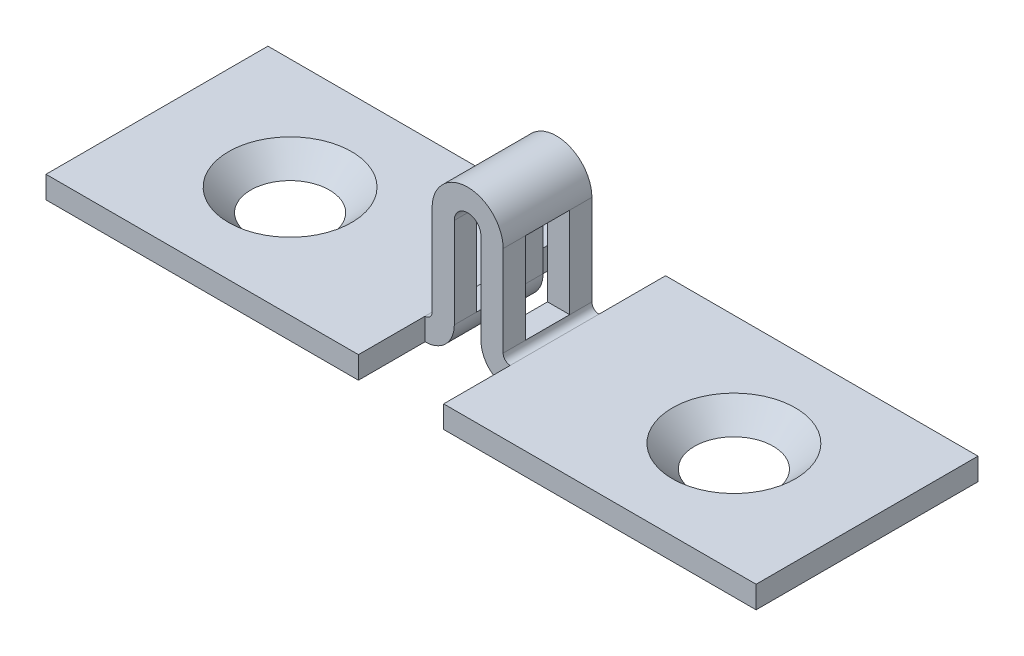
ISO-10303-21;
HEADER;
FILE_DESCRIPTION(('STEP AP214'),'2;1');
FILE_NAME('part.step','',(''),(''),'','','');
FILE_SCHEMA(('AUTOMOTIVE_DESIGN { 1 0 10303 214 1 1 1 1 }'));
ENDSEC;
DATA;
#1=APPLICATION_CONTEXT('core data for automotive mechanical design processes');
#2=APPLICATION_PROTOCOL_DEFINITION('international standard','automotive_design',2000,#1);
#3=PRODUCT_CONTEXT('',#1,'mechanical');
#4=PRODUCT('Part','Part','',(#3));
#5=PRODUCT_RELATED_PRODUCT_CATEGORY('part','',(#4));
#6=PRODUCT_DEFINITION_FORMATION('','',#4);
#7=PRODUCT_DEFINITION_CONTEXT('part definition',#1,'design');
#8=PRODUCT_DEFINITION('design','',#6,#7);
#9=PRODUCT_DEFINITION_SHAPE('','',#8);
#10=(LENGTH_UNIT() NAMED_UNIT(*) SI_UNIT(.MILLI.,.METRE.));
#11=(NAMED_UNIT(*) PLANE_ANGLE_UNIT() SI_UNIT($,.RADIAN.));
#12=(NAMED_UNIT(*) SI_UNIT($,.STERADIAN.) SOLID_ANGLE_UNIT());
#13=UNCERTAINTY_MEASURE_WITH_UNIT(LENGTH_MEASURE(1.E-05),#10,'distance_accuracy_value','');
#14=(GEOMETRIC_REPRESENTATION_CONTEXT(3) GLOBAL_UNCERTAINTY_ASSIGNED_CONTEXT((#13)) GLOBAL_UNIT_ASSIGNED_CONTEXT((#10,
#11,#12)) REPRESENTATION_CONTEXT('',''));
#15=CARTESIAN_POINT('',(0.,0.,0.));
#16=DIRECTION('',(0.,0.,1.));
#17=DIRECTION('',(1.,0.,0.));
#18=AXIS2_PLACEMENT_3D('',#15,#16,#17);
#19=CARTESIAN_POINT('',(1.27,0.253999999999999,3.96875));
#20=DIRECTION('',(1.,0.,0.));
#21=DIRECTION('',(0.,0.,-1.));
#22=AXIS2_PLACEMENT_3D('',#19,#20,#21);
#23=PLANE('',#22);
#24=DIRECTION('',(0.,1.,0.));
#25=VECTOR('',#24,1.);
#26=CARTESIAN_POINT('',(1.27,0.253999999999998,-0.793749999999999));
#27=LINE('',#26,#25);
#28=CARTESIAN_POINT('',(1.27,0.253999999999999,-0.79375));
#29=VERTEX_POINT('',#28);
#30=CARTESIAN_POINT('',(1.27,3.4925,-0.79375));
#31=VERTEX_POINT('',#30);
#32=EDGE_CURVE('E497',#29,#31,#27,.T.);
#33=ORIENTED_EDGE('',*,*,#32,.F.);
#34=DIRECTION('',(0.,0.,-1.));
#35=VECTOR('',#34,1.);
#36=CARTESIAN_POINT('',(1.27,0.253999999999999,3.96875));
#37=LINE('',#36,#35);
#38=CARTESIAN_POINT('',(1.27,0.253999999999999,-1.5875));
#39=VERTEX_POINT('',#38);
#40=EDGE_CURVE('E264',#29,#39,#37,.T.);
#41=ORIENTED_EDGE('',*,*,#40,.T.);
#42=DIRECTION('',(0.,-1.,0.));
#43=VECTOR('',#42,1.);
#44=CARTESIAN_POINT('',(1.27,0.253999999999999,-1.5875));
#45=LINE('',#44,#43);
#46=CARTESIAN_POINT('',(1.27,3.4925,-1.5875));
#47=VERTEX_POINT('',#46);
#48=EDGE_CURVE('E460',#47,#39,#45,.T.);
#49=ORIENTED_EDGE('',*,*,#48,.F.);
#50=DIRECTION('',(0.,0.,-1.));
#51=VECTOR('',#50,1.);
#52=CARTESIAN_POINT('',(1.27,3.4925,3.96875));
#53=LINE('',#52,#51);
#54=EDGE_CURVE('E260',#31,#47,#53,.T.);
#55=ORIENTED_EDGE('',*,*,#54,.F.);
#56=EDGE_LOOP('',(#33,#41,#49,#55));
#57=FACE_BOUND('',#56,.T.);
#58=ADVANCED_FACE('F32',(#57),#23,.T.);
#59=CARTESIAN_POINT('',(-1.27,0.253999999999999,3.96875));
#60=DIRECTION('',(-1.,0.,0.));
#61=DIRECTION('',(0.,0.,1.));
#62=AXIS2_PLACEMENT_3D('',#59,#60,#61);
#63=PLANE('',#62);
#64=DIRECTION('',(0.,-1.,0.));
#65=VECTOR('',#64,1.);
#66=CARTESIAN_POINT('',(-1.27,0.253999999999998,-0.793749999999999));
#67=LINE('',#66,#65);
#68=CARTESIAN_POINT('',(-1.27,3.4925,-0.79375));
#69=VERTEX_POINT('',#68);
#70=CARTESIAN_POINT('',(-1.27,0.253999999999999,-0.79375));
#71=VERTEX_POINT('',#70);
#72=EDGE_CURVE('E495',#69,#71,#67,.T.);
#73=ORIENTED_EDGE('',*,*,#72,.F.);
#74=DIRECTION('',(0.,0.,-1.));
#75=VECTOR('',#74,1.);
#76=CARTESIAN_POINT('',(-1.27,3.4925,3.96875));
#77=LINE('',#76,#75);
#78=CARTESIAN_POINT('',(-1.27,3.4925,-1.5875));
#79=VERTEX_POINT('',#78);
#80=EDGE_CURVE('E252',#69,#79,#77,.T.);
#81=ORIENTED_EDGE('',*,*,#80,.T.);
#82=DIRECTION('',(0.,1.,0.));
#83=VECTOR('',#82,1.);
#84=CARTESIAN_POINT('',(-1.27,0.253999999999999,-1.5875));
#85=LINE('',#84,#83);
#86=CARTESIAN_POINT('',(-1.27,0.253999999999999,-1.5875));
#87=VERTEX_POINT('',#86);
#88=EDGE_CURVE('E454',#87,#79,#85,.T.);
#89=ORIENTED_EDGE('',*,*,#88,.F.);
#90=DIRECTION('',(0.,0.,-1.));
#91=VECTOR('',#90,1.);
#92=CARTESIAN_POINT('',(-1.27,0.253999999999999,3.96875));
#93=LINE('',#92,#91);
#94=EDGE_CURVE('E253',#71,#87,#93,.T.);
#95=ORIENTED_EDGE('',*,*,#94,.F.);
#96=EDGE_LOOP('',(#73,#81,#89,#95));
#97=FACE_BOUND('',#96,.T.);
#98=ADVANCED_FACE('F534',(#97),#63,.T.);
#99=CARTESIAN_POINT('',(-0.47625,0.253999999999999,3.96875));
#100=DIRECTION('',(-1.,0.,0.));
#101=DIRECTION('',(0.,0.,1.));
#102=AXIS2_PLACEMENT_3D('',#99,#100,#101);
#103=PLANE('',#102);
#104=DIRECTION('',(0.,0.,-1.));
#105=VECTOR('',#104,1.);
#106=CARTESIAN_POINT('',(-0.47625,3.4925,3.96875));
#107=LINE('',#106,#105);
#108=CARTESIAN_POINT('',(-0.47625,3.4925,-0.79375));
#109=VERTEX_POINT('',#108);
#110=CARTESIAN_POINT('',(-0.47625,3.4925,-1.5875));
#111=VERTEX_POINT('',#110);
#112=EDGE_CURVE('E326',#109,#111,#107,.T.);
#113=ORIENTED_EDGE('',*,*,#112,.F.);
#114=DIRECTION('',(0.,-1.,0.));
#115=VECTOR('',#114,1.);
#116=CARTESIAN_POINT('',(-0.47625,0.253999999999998,-0.793749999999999));
#117=LINE('',#116,#115);
#118=CARTESIAN_POINT('',(-0.476250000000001,0.253999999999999,-0.79375));
#119=VERTEX_POINT('',#118);
#120=EDGE_CURVE('E492',#109,#119,#117,.T.);
#121=ORIENTED_EDGE('',*,*,#120,.T.);
#122=DIRECTION('',(0.,0.,-1.));
#123=VECTOR('',#122,1.);
#124=CARTESIAN_POINT('',(-0.47625,0.253999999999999,3.96875));
#125=LINE('',#124,#123);
#126=CARTESIAN_POINT('',(-0.47625,0.253999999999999,-1.5875));
#127=VERTEX_POINT('',#126);
#128=EDGE_CURVE('E331',#119,#127,#125,.T.);
#129=ORIENTED_EDGE('',*,*,#128,.T.);
#130=DIRECTION('',(0.,1.,0.));
#131=VECTOR('',#130,1.);
#132=CARTESIAN_POINT('',(-0.47625,0.253999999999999,-1.5875));
#133=LINE('',#132,#131);
#134=EDGE_CURVE('E446',#127,#111,#133,.T.);
#135=ORIENTED_EDGE('',*,*,#134,.T.);
#136=EDGE_LOOP('',(#113,#121,#129,#135));
#137=FACE_BOUND('',#136,.T.);
#138=ADVANCED_FACE('F541',(#137),#103,.F.);
#139=CARTESIAN_POINT('',(0.47625,0.253999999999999,3.96875));
#140=DIRECTION('',(1.,0.,0.));
#141=DIRECTION('',(0.,0.,-1.));
#142=AXIS2_PLACEMENT_3D('',#139,#140,#141);
#143=PLANE('',#142);
#144=DIRECTION('',(0.,0.,-1.));
#145=VECTOR('',#144,1.);
#146=CARTESIAN_POINT('',(0.476250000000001,0.253999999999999,3.96875));
#147=LINE('',#146,#145);
#148=CARTESIAN_POINT('',(0.476250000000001,0.253999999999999,-0.79375));
#149=VERTEX_POINT('',#148);
#150=CARTESIAN_POINT('',(0.476250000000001,0.253999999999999,-1.5875));
#151=VERTEX_POINT('',#150);
#152=EDGE_CURVE('E316',#149,#151,#147,.T.);
#153=ORIENTED_EDGE('',*,*,#152,.F.);
#154=DIRECTION('',(0.,1.,0.));
#155=VECTOR('',#154,1.);
#156=CARTESIAN_POINT('',(0.47625,0.253999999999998,-0.793749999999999));
#157=LINE('',#156,#155);
#158=CARTESIAN_POINT('',(0.476250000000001,3.4925,-0.79375));
#159=VERTEX_POINT('',#158);
#160=EDGE_CURVE('E489',#149,#159,#157,.T.);
#161=ORIENTED_EDGE('',*,*,#160,.T.);
#162=DIRECTION('',(0.,0.,-1.));
#163=VECTOR('',#162,1.);
#164=CARTESIAN_POINT('',(0.47625,3.4925,3.96875));
#165=LINE('',#164,#163);
#166=CARTESIAN_POINT('',(0.47625,3.4925,-1.5875));
#167=VERTEX_POINT('',#166);
#168=EDGE_CURVE('E321',#159,#167,#165,.T.);
#169=ORIENTED_EDGE('',*,*,#168,.T.);
#170=DIRECTION('',(0.,-1.,0.));
#171=VECTOR('',#170,1.);
#172=CARTESIAN_POINT('',(0.47625,0.253999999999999,-1.5875));
#173=LINE('',#172,#171);
#174=EDGE_CURVE('E440',#167,#151,#173,.T.);
#175=ORIENTED_EDGE('',*,*,#174,.T.);
#176=EDGE_LOOP('',(#153,#161,#169,#175));
#177=FACE_BOUND('',#176,.T.);
#178=ADVANCED_FACE('F633',(#177),#143,.F.);
#179=CARTESIAN_POINT('',(1.524,0.253999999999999,-3.96875));
#180=DIRECTION('',(0.,0.,1.));
#181=DIRECTION('',(1.,0.,0.));
#182=AXIS2_PLACEMENT_3D('',#179,#180,#181);
#183=PLANE('',#182);
#184=DIRECTION('',(1.,0.,0.));
#185=VECTOR('',#184,1.);
#186=CARTESIAN_POINT('',(-12.7,0.,-3.96875));
#187=LINE('',#186,#185);
#188=CARTESIAN_POINT('',(-12.7,0.,-3.96875));
#189=VERTEX_POINT('',#188);
#190=CARTESIAN_POINT('',(-1.524,0.,-3.96875));
#191=VERTEX_POINT('',#190);
#192=EDGE_CURVE('E294',#189,#191,#187,.T.);
#193=ORIENTED_EDGE('',*,*,#192,.T.);
#194=DIRECTION('',(0.,-1.,0.));
#195=VECTOR('',#194,1.);
#196=CARTESIAN_POINT('',(-1.524,0.253999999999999,-3.96875));
#197=LINE('',#196,#195);
#198=CARTESIAN_POINT('',(-1.524,-0.79375,-3.96875));
#199=VERTEX_POINT('',#198);
#200=EDGE_CURVE('E40',#191,#199,#197,.T.);
#201=ORIENTED_EDGE('',*,*,#200,.T.);
#202=DIRECTION('',(1.,0.,0.));
#203=VECTOR('',#202,1.);
#204=CARTESIAN_POINT('',(-12.7,-0.793750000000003,-3.96875));
#205=LINE('',#204,#203);
#206=CARTESIAN_POINT('',(-12.7,-0.793750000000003,-3.96875));
#207=VERTEX_POINT('',#206);
#208=EDGE_CURVE('E291',#207,#199,#205,.T.);
#209=ORIENTED_EDGE('',*,*,#208,.F.);
#210=DIRECTION('',(0.,1.,0.));
#211=VECTOR('',#210,1.);
#212=CARTESIAN_POINT('',(-12.7,-0.793750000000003,-3.96875));
#213=LINE('',#212,#211);
#214=EDGE_CURVE('E306',#207,#189,#213,.T.);
#215=ORIENTED_EDGE('',*,*,#214,.T.);
#216=EDGE_LOOP('',(#193,#201,#209,#215));
#217=FACE_BOUND('',#216,.T.);
#218=ADVANCED_FACE('F289',(#217),#183,.F.);
#219=CARTESIAN_POINT('',(1.524,0.253999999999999,3.96875));
#220=DIRECTION('',(0.,0.,1.));
#221=DIRECTION('',(1.,0.,0.));
#222=AXIS2_PLACEMENT_3D('',#219,#220,#221);
#223=PLANE('',#222);
#224=DIRECTION('',(0.,-1.,0.));
#225=VECTOR('',#224,1.);
#226=CARTESIAN_POINT('',(-1.524,0.253999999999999,3.96875));
#227=LINE('',#226,#225);
#228=CARTESIAN_POINT('',(-1.524,0.,3.96875));
#229=VERTEX_POINT('',#228);
#230=CARTESIAN_POINT('',(-1.524,-0.79375,3.96875));
#231=VERTEX_POINT('',#230);
#232=EDGE_CURVE('E277',#229,#231,#227,.T.);
#233=ORIENTED_EDGE('',*,*,#232,.F.);
#234=DIRECTION('',(1.,0.,0.));
#235=VECTOR('',#234,1.);
#236=CARTESIAN_POINT('',(-12.7,0.,3.96875));
#237=LINE('',#236,#235);
#238=CARTESIAN_POINT('',(-12.7,0.,3.96875));
#239=VERTEX_POINT('',#238);
#240=EDGE_CURVE('E349',#239,#229,#237,.T.);
#241=ORIENTED_EDGE('',*,*,#240,.F.);
#242=DIRECTION('',(0.,1.,0.));
#243=VECTOR('',#242,1.);
#244=CARTESIAN_POINT('',(-12.7,-0.793750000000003,3.96875));
#245=LINE('',#244,#243);
#246=CARTESIAN_POINT('',(-12.7,-0.793750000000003,3.96875));
#247=VERTEX_POINT('',#246);
#248=EDGE_CURVE('E361',#247,#239,#245,.T.);
#249=ORIENTED_EDGE('',*,*,#248,.F.);
#250=DIRECTION('',(1.,0.,0.));
#251=VECTOR('',#250,1.);
#252=CARTESIAN_POINT('',(-12.7,-0.793750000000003,3.96875));
#253=LINE('',#252,#251);
#254=EDGE_CURVE('E359',#247,#231,#253,.T.);
#255=ORIENTED_EDGE('',*,*,#254,.T.);
#256=EDGE_LOOP('',(#233,#241,#249,#255));
#257=FACE_BOUND('',#256,.T.);
#258=ADVANCED_FACE('F357',(#257),#223,.T.);
#259=CARTESIAN_POINT('',(12.7,-0.793750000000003,3.96875));
#260=DIRECTION('',(0.,1.,0.));
#261=DIRECTION('',(-1.,0.,0.));
#262=AXIS2_PLACEMENT_3D('',#259,#260,#261);
#263=PLANE('',#262);
#264=CARTESIAN_POINT('',(7.9375,-0.793750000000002,0.));
#265=DIRECTION('',(0.,1.,0.));
#266=DIRECTION('',(-1.,0.,0.));
#267=AXIS2_PLACEMENT_3D('',#264,#265,#266);
#268=CIRCLE('',#267,1.40624999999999);
#269=CARTESIAN_POINT('',(6.53125000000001,-0.793750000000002,0.));
#270=VERTEX_POINT('',#269);
#271=EDGE_CURVE('E508',#270,#270,#268,.T.);
#272=ORIENTED_EDGE('',*,*,#271,.T.);
#273=EDGE_LOOP('',(#272));
#274=FACE_BOUND('',#273,.T.);
#275=DIRECTION('',(1.,0.,0.));
#276=VECTOR('',#275,1.);
#277=CARTESIAN_POINT('',(12.7,-0.793750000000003,-3.96875));
#278=LINE('',#277,#276);
#279=CARTESIAN_POINT('',(1.524,-0.79375,-3.96875));
#280=VERTEX_POINT('',#279);
#281=CARTESIAN_POINT('',(12.7,-0.793750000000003,-3.96875));
#282=VERTEX_POINT('',#281);
#283=EDGE_CURVE('E385',#280,#282,#278,.T.);
#284=ORIENTED_EDGE('',*,*,#283,.T.);
#285=DIRECTION('',(0.,0.,-1.));
#286=VECTOR('',#285,1.);
#287=CARTESIAN_POINT('',(12.7,-0.793750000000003,3.96875));
#288=LINE('',#287,#286);
#289=CARTESIAN_POINT('',(12.7,-0.793750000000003,3.96875));
#290=VERTEX_POINT('',#289);
#291=EDGE_CURVE('E273',#290,#282,#288,.T.);
#292=ORIENTED_EDGE('',*,*,#291,.F.);
#293=DIRECTION('',(1.,0.,0.));
#294=VECTOR('',#293,1.);
#295=CARTESIAN_POINT('',(12.7,-0.793750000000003,3.96875));
#296=LINE('',#295,#294);
#297=CARTESIAN_POINT('',(1.524,-0.79375,3.96875));
#298=VERTEX_POINT('',#297);
#299=EDGE_CURVE('E305',#298,#290,#296,.T.);
#300=ORIENTED_EDGE('',*,*,#299,.F.);
#301=DIRECTION('',(0.,0.,-1.));
#302=VECTOR('',#301,1.);
#303=CARTESIAN_POINT('',(1.524,-0.79375,3.96875));
#304=LINE('',#303,#302);
#305=CARTESIAN_POINT('',(1.524,-0.79375,1.5875));
#306=VERTEX_POINT('',#305);
#307=EDGE_CURVE('E313',#298,#306,#304,.T.);
#308=ORIENTED_EDGE('',*,*,#307,.T.);
#309=CARTESIAN_POINT('',(1.524,-0.79375,-1.5875));
#310=VERTEX_POINT('',#309);
#311=EDGE_CURVE('E317',#306,#310,#304,.T.);
#312=ORIENTED_EDGE('',*,*,#311,.T.);
#313=DIRECTION('',(0.,0.,1.));
#314=VECTOR('',#313,1.);
#315=CARTESIAN_POINT('',(1.524,-0.79375,-3.96875));
#316=LINE('',#315,#314);
#317=EDGE_CURVE('E423',#280,#310,#316,.T.);
#318=ORIENTED_EDGE('',*,*,#317,.F.);
#319=EDGE_LOOP('',(#284,#292,#300,#308,#312,#318));
#320=FACE_BOUND('',#319,.T.);
#321=ADVANCED_FACE('F34',(#274,#320),#263,.F.);
#322=CARTESIAN_POINT('',(12.7,0.,3.96875));
#323=DIRECTION('',(1.,0.,0.));
#324=DIRECTION('',(0.,0.,-1.));
#325=AXIS2_PLACEMENT_3D('',#322,#323,#324);
#326=PLANE('',#325);
#327=DIRECTION('',(0.,-1.,0.));
#328=VECTOR('',#327,1.);
#329=CARTESIAN_POINT('',(12.7,0.,-3.96875));
#330=LINE('',#329,#328);
#331=CARTESIAN_POINT('',(12.7,0.,-3.96875));
#332=VERTEX_POINT('',#331);
#333=EDGE_CURVE('E396',#332,#282,#330,.T.);
#334=ORIENTED_EDGE('',*,*,#333,.F.);
#335=DIRECTION('',(0.,0.,-1.));
#336=VECTOR('',#335,1.);
#337=CARTESIAN_POINT('',(12.7,0.,3.96875));
#338=LINE('',#337,#336);
#339=CARTESIAN_POINT('',(12.7,0.,3.96875));
#340=VERTEX_POINT('',#339);
#341=EDGE_CURVE('E271',#340,#332,#338,.T.);
#342=ORIENTED_EDGE('',*,*,#341,.F.);
#343=DIRECTION('',(0.,-1.,0.));
#344=VECTOR('',#343,1.);
#345=CARTESIAN_POINT('',(12.7,0.,3.96875));
#346=LINE('',#345,#344);
#347=EDGE_CURVE('E308',#340,#290,#346,.T.);
#348=ORIENTED_EDGE('',*,*,#347,.T.);
#349=ORIENTED_EDGE('',*,*,#291,.T.);
#350=EDGE_LOOP('',(#334,#342,#348,#349));
#351=FACE_BOUND('',#350,.T.);
#352=ADVANCED_FACE('F416',(#351),#326,.T.);
#353=CARTESIAN_POINT('',(12.7,0.,3.96875));
#354=DIRECTION('',(0.,1.,0.));
#355=DIRECTION('',(-1.,0.,0.));
#356=AXIS2_PLACEMENT_3D('',#353,#354,#355);
#357=PLANE('',#356);
#358=CARTESIAN_POINT('',(7.9375,0.,0.));
#359=DIRECTION('',(0.,1.,0.));
#360=DIRECTION('',(0.,0.,1.));
#361=AXIS2_PLACEMENT_3D('',#358,#359,#360);
#362=CIRCLE('',#361,2.2);
#363=CARTESIAN_POINT('',(7.9375,0.,2.2));
#364=VERTEX_POINT('',#363);
#365=EDGE_CURVE('E505',#364,#364,#362,.T.);
#366=ORIENTED_EDGE('',*,*,#365,.F.);
#367=EDGE_LOOP('',(#366));
#368=FACE_BOUND('',#367,.T.);
#369=DIRECTION('',(1.,0.,0.));
#370=VECTOR('',#369,1.);
#371=CARTESIAN_POINT('',(12.7,0.,-3.96875));
#372=LINE('',#371,#370);
#373=CARTESIAN_POINT('',(1.524,0.,-3.96875));
#374=VERTEX_POINT('',#373);
#375=EDGE_CURVE('E399',#374,#332,#372,.T.);
#376=ORIENTED_EDGE('',*,*,#375,.F.);
#377=DIRECTION('',(0.,0.,-1.));
#378=VECTOR('',#377,1.);
#379=CARTESIAN_POINT('',(1.524,0.,3.96875));
#380=LINE('',#379,#378);
#381=CARTESIAN_POINT('',(1.524,0.,-1.5875));
#382=VERTEX_POINT('',#381);
#383=EDGE_CURVE('E410',#382,#374,#380,.T.);
#384=ORIENTED_EDGE('',*,*,#383,.F.);
#385=DIRECTION('',(0.,0.,-1.));
#386=VECTOR('',#385,1.);
#387=CARTESIAN_POINT('',(1.524,0.,3.96875));
#388=LINE('',#387,#386);
#389=CARTESIAN_POINT('',(1.524,0.,1.5875));
#390=VERTEX_POINT('',#389);
#391=EDGE_CURVE('E268',#390,#382,#388,.T.);
#392=ORIENTED_EDGE('',*,*,#391,.F.);
#393=CARTESIAN_POINT('',(1.524,0.,3.96875));
#394=VERTEX_POINT('',#393);
#395=EDGE_CURVE('E269',#394,#390,#388,.T.);
#396=ORIENTED_EDGE('',*,*,#395,.F.);
#397=DIRECTION('',(1.,0.,0.));
#398=VECTOR('',#397,1.);
#399=CARTESIAN_POINT('',(12.7,0.,3.96875));
#400=LINE('',#399,#398);
#401=EDGE_CURVE('E389',#394,#340,#400,.T.);
#402=ORIENTED_EDGE('',*,*,#401,.T.);
#403=ORIENTED_EDGE('',*,*,#341,.T.);
#404=EDGE_LOOP('',(#376,#384,#392,#396,#402,#403));
#405=FACE_BOUND('',#404,.T.);
#406=ADVANCED_FACE('F408',(#368,#405),#357,.T.);
#407=CARTESIAN_POINT('',(1.524,0.253999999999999,3.96875));
#408=DIRECTION('',(0.,0.,-1.));
#409=DIRECTION('',(-1.,0.,0.));
#410=AXIS2_PLACEMENT_3D('',#407,#408,#409);
#411=CYLINDRICAL_SURFACE('',#410,0.254);
#412=CARTESIAN_POINT('',(1.524,0.253999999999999,-1.5875));
#413=DIRECTION('',(0.,0.,1.));
#414=DIRECTION('',(1.,0.,0.));
#415=AXIS2_PLACEMENT_3D('',#412,#413,#414);
#416=CIRCLE('',#415,0.254);
#417=EDGE_CURVE('E463',#39,#382,#416,.T.);
#418=ORIENTED_EDGE('',*,*,#417,.F.);
#419=ORIENTED_EDGE('',*,*,#40,.F.);
#420=DIRECTION('',(0.,0.,-1.));
#421=VECTOR('',#420,1.);
#422=CARTESIAN_POINT('',(1.27,0.253999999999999,3.96875));
#423=LINE('',#422,#421);
#424=CARTESIAN_POINT('',(1.27,0.253999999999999,0.79375));
#425=VERTEX_POINT('',#424);
#426=EDGE_CURVE('E223',#425,#29,#423,.T.);
#427=ORIENTED_EDGE('',*,*,#426,.F.);
#428=CARTESIAN_POINT('',(1.27,0.253999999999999,1.5875));
#429=VERTEX_POINT('',#428);
#430=EDGE_CURVE('E265',#429,#425,#37,.T.);
#431=ORIENTED_EDGE('',*,*,#430,.F.);
#432=CARTESIAN_POINT('',(1.524,0.253999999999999,1.5875));
#433=DIRECTION('',(0.,0.,-1.));
#434=DIRECTION('',(-1.,0.,0.));
#435=AXIS2_PLACEMENT_3D('',#432,#433,#434);
#436=CIRCLE('',#435,0.254);
#437=EDGE_CURVE('E384',#390,#429,#436,.T.);
#438=ORIENTED_EDGE('',*,*,#437,.F.);
#439=ORIENTED_EDGE('',*,*,#391,.T.);
#440=EDGE_LOOP('',(#418,#419,#427,#431,#438,#439));
#441=FACE_BOUND('',#440,.T.);
#442=ADVANCED_FACE('F549',(#441),#411,.F.);
#443=DIRECTION('',(0.,-1.,0.));
#444=VECTOR('',#443,1.);
#445=CARTESIAN_POINT('',(1.27,0.253999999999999,0.79375));
#446=LINE('',#445,#444);
#447=CARTESIAN_POINT('',(1.27,3.4925,0.79375));
#448=VERTEX_POINT('',#447);
#449=EDGE_CURVE('E245',#448,#425,#446,.T.);
#450=ORIENTED_EDGE('',*,*,#449,.F.);
#451=CARTESIAN_POINT('',(1.27,3.4925,1.5875));
#452=VERTEX_POINT('',#451);
#453=EDGE_CURVE('E261',#452,#448,#53,.T.);
#454=ORIENTED_EDGE('',*,*,#453,.F.);
#455=DIRECTION('',(0.,1.,0.));
#456=VECTOR('',#455,1.);
#457=CARTESIAN_POINT('',(1.27,0.253999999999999,1.5875));
#458=LINE('',#457,#456);
#459=EDGE_CURVE('E382',#429,#452,#458,.T.);
#460=ORIENTED_EDGE('',*,*,#459,.F.);
#461=ORIENTED_EDGE('',*,*,#430,.T.);
#462=EDGE_LOOP('',(#450,#454,#460,#461));
#463=FACE_BOUND('',#462,.T.);
#464=ADVANCED_FACE('F537',(#463),#23,.T.);
#465=CARTESIAN_POINT('',(0.,3.4925,3.96875));
#466=DIRECTION('',(0.,0.,-1.));
#467=DIRECTION('',(-1.,0.,0.));
#468=AXIS2_PLACEMENT_3D('',#465,#466,#467);
#469=CYLINDRICAL_SURFACE('',#468,1.27);
#470=CARTESIAN_POINT('',(0.,3.4925,-1.5875));
#471=DIRECTION('',(0.,0.,1.));
#472=DIRECTION('',(1.,0.,0.));
#473=AXIS2_PLACEMENT_3D('',#470,#471,#472);
#474=CIRCLE('',#473,1.27);
#475=EDGE_CURVE('E457',#79,#47,#474,.F.);
#476=ORIENTED_EDGE('',*,*,#475,.F.);
#477=ORIENTED_EDGE('',*,*,#80,.F.);
#478=DIRECTION('',(0.,0.,-1.));
#479=VECTOR('',#478,1.);
#480=CARTESIAN_POINT('',(-1.27,3.4925,3.96875));
#481=LINE('',#480,#479);
#482=CARTESIAN_POINT('',(-1.27,3.4925,0.79375));
#483=VERTEX_POINT('',#482);
#484=EDGE_CURVE('E501',#483,#69,#481,.T.);
#485=ORIENTED_EDGE('',*,*,#484,.F.);
#486=CARTESIAN_POINT('',(-1.27,3.4925,1.5875));
#487=VERTEX_POINT('',#486);
#488=EDGE_CURVE('E244',#487,#483,#77,.T.);
#489=ORIENTED_EDGE('',*,*,#488,.F.);
#490=CARTESIAN_POINT('',(0.,3.4925,1.5875));
#491=DIRECTION('',(0.,0.,-1.));
#492=DIRECTION('',(-1.,0.,0.));
#493=AXIS2_PLACEMENT_3D('',#490,#491,#492);
#494=CIRCLE('',#493,1.27);
#495=EDGE_CURVE('E380',#452,#487,#494,.F.);
#496=ORIENTED_EDGE('',*,*,#495,.F.);
#497=ORIENTED_EDGE('',*,*,#453,.T.);
#498=DIRECTION('',(0.,0.,-1.));
#499=VECTOR('',#498,1.);
#500=CARTESIAN_POINT('',(1.27,3.4925,3.96875));
#501=LINE('',#500,#499);
#502=EDGE_CURVE('E503',#31,#448,#501,.F.);
#503=ORIENTED_EDGE('',*,*,#502,.F.);
#504=ORIENTED_EDGE('',*,*,#54,.T.);
#505=EDGE_LOOP('',(#476,#477,#485,#489,#496,#497,#503,#504));
#506=FACE_BOUND('',#505,.T.);
#507=ADVANCED_FACE('F548',(#506),#469,.T.);
#508=DIRECTION('',(0.,1.,0.));
#509=VECTOR('',#508,1.);
#510=CARTESIAN_POINT('',(-1.27,0.253999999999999,0.79375));
#511=LINE('',#510,#509);
#512=CARTESIAN_POINT('',(-1.27,0.253999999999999,0.79375));
#513=VERTEX_POINT('',#512);
#514=EDGE_CURVE('E230',#513,#483,#511,.T.);
#515=ORIENTED_EDGE('',*,*,#514,.F.);
#516=CARTESIAN_POINT('',(-1.27,0.253999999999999,1.5875));
#517=VERTEX_POINT('',#516);
#518=EDGE_CURVE('E242',#517,#513,#93,.T.);
#519=ORIENTED_EDGE('',*,*,#518,.F.);
#520=DIRECTION('',(0.,-1.,0.));
#521=VECTOR('',#520,1.);
#522=CARTESIAN_POINT('',(-1.27,0.253999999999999,1.5875));
#523=LINE('',#522,#521);
#524=EDGE_CURVE('E373',#487,#517,#523,.T.);
#525=ORIENTED_EDGE('',*,*,#524,.F.);
#526=ORIENTED_EDGE('',*,*,#488,.T.);
#527=EDGE_LOOP('',(#515,#519,#525,#526));
#528=FACE_BOUND('',#527,.T.);
#529=ADVANCED_FACE('F240',(#528),#63,.T.);
#530=CARTESIAN_POINT('',(-1.524,0.253999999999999,3.96875));
#531=DIRECTION('',(0.,0.,-1.));
#532=DIRECTION('',(-1.,0.,0.));
#533=AXIS2_PLACEMENT_3D('',#530,#531,#532);
#534=CYLINDRICAL_SURFACE('',#533,0.254);
#535=CARTESIAN_POINT('',(-1.524,0.253999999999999,-1.5875));
#536=DIRECTION('',(0.,0.,1.));
#537=DIRECTION('',(1.,0.,0.));
#538=AXIS2_PLACEMENT_3D('',#535,#536,#537);
#539=CIRCLE('',#538,0.254);
#540=CARTESIAN_POINT('',(-1.524,0.,-1.5875));
#541=VERTEX_POINT('',#540);
#542=EDGE_CURVE('E451',#541,#87,#539,.T.);
#543=ORIENTED_EDGE('',*,*,#542,.F.);
#544=DIRECTION('',(0.,0.,-1.));
#545=VECTOR('',#544,1.);
#546=CARTESIAN_POINT('',(-1.524,0.,3.96875));
#547=LINE('',#546,#545);
#548=CARTESIAN_POINT('',(-1.524,0.,1.5875));
#549=VERTEX_POINT('',#548);
#550=EDGE_CURVE('E340',#549,#541,#547,.T.);
#551=ORIENTED_EDGE('',*,*,#550,.F.);
#552=CARTESIAN_POINT('',(-1.524,0.253999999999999,1.5875));
#553=DIRECTION('',(0.,0.,-1.));
#554=DIRECTION('',(-1.,0.,0.));
#555=AXIS2_PLACEMENT_3D('',#552,#553,#554);
#556=CIRCLE('',#555,0.254);
#557=EDGE_CURVE('E251',#517,#549,#556,.T.);
#558=ORIENTED_EDGE('',*,*,#557,.F.);
#559=ORIENTED_EDGE('',*,*,#518,.T.);
#560=DIRECTION('',(0.,0.,-1.));
#561=VECTOR('',#560,1.);
#562=CARTESIAN_POINT('',(-1.27,0.253999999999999,3.96875));
#563=LINE('',#562,#561);
#564=EDGE_CURVE('E216',#71,#513,#563,.F.);
#565=ORIENTED_EDGE('',*,*,#564,.F.);
#566=ORIENTED_EDGE('',*,*,#94,.T.);
#567=EDGE_LOOP('',(#543,#551,#558,#559,#565,#566));
#568=FACE_BOUND('',#567,.T.);
#569=ADVANCED_FACE('F249',(#568),#534,.F.);
#570=CARTESIAN_POINT('',(-12.7,0.,3.96875));
#571=DIRECTION('',(0.,1.,0.));
#572=DIRECTION('',(-1.,0.,0.));
#573=AXIS2_PLACEMENT_3D('',#570,#571,#572);
#574=PLANE('',#573);
#575=CARTESIAN_POINT('',(-7.9375,0.,0.));
#576=DIRECTION('',(0.,1.,0.));
#577=DIRECTION('',(0.,0.,1.));
#578=AXIS2_PLACEMENT_3D('',#575,#576,#577);
#579=CIRCLE('',#578,2.2);
#580=CARTESIAN_POINT('',(-7.9375,0.,2.2));
#581=VERTEX_POINT('',#580);
#582=EDGE_CURVE('E511',#581,#581,#579,.T.);
#583=ORIENTED_EDGE('',*,*,#582,.F.);
#584=EDGE_LOOP('',(#583));
#585=FACE_BOUND('',#584,.T.);
#586=ORIENTED_EDGE('',*,*,#192,.F.);
#587=DIRECTION('',(0.,0.,-1.));
#588=VECTOR('',#587,1.);
#589=CARTESIAN_POINT('',(-12.7,0.,3.96875));
#590=LINE('',#589,#588);
#591=EDGE_CURVE('E339',#239,#189,#590,.T.);
#592=ORIENTED_EDGE('',*,*,#591,.F.);
#593=ORIENTED_EDGE('',*,*,#240,.T.);
#594=EDGE_CURVE('E256',#229,#549,#547,.T.);
#595=ORIENTED_EDGE('',*,*,#594,.T.);
#596=ORIENTED_EDGE('',*,*,#550,.T.);
#597=DIRECTION('',(0.,0.,1.));
#598=VECTOR('',#597,1.);
#599=CARTESIAN_POINT('',(-1.524,0.,3.96875));
#600=LINE('',#599,#598);
#601=EDGE_CURVE('E438',#191,#541,#600,.T.);
#602=ORIENTED_EDGE('',*,*,#601,.F.);
#603=EDGE_LOOP('',(#586,#592,#593,#595,#596,#602));
#604=FACE_BOUND('',#603,.T.);
#605=ADVANCED_FACE('F347',(#585,#604),#574,.T.);
#606=CARTESIAN_POINT('',(-12.7,-0.793750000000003,3.96875));
#607=DIRECTION('',(-1.,0.,0.));
#608=DIRECTION('',(0.,0.,1.));
#609=AXIS2_PLACEMENT_3D('',#606,#607,#608);
#610=PLANE('',#609);
#611=ORIENTED_EDGE('',*,*,#214,.F.);
#612=DIRECTION('',(0.,0.,-1.));
#613=VECTOR('',#612,1.);
#614=CARTESIAN_POINT('',(-12.7,-0.793750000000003,3.96875));
#615=LINE('',#614,#613);
#616=EDGE_CURVE('E304',#247,#207,#615,.T.);
#617=ORIENTED_EDGE('',*,*,#616,.F.);
#618=ORIENTED_EDGE('',*,*,#248,.T.);
#619=ORIENTED_EDGE('',*,*,#591,.T.);
#620=EDGE_LOOP('',(#611,#617,#618,#619));
#621=FACE_BOUND('',#620,.T.);
#622=ADVANCED_FACE('F649',(#621),#610,.T.);
#623=CARTESIAN_POINT('',(-12.7,-0.793750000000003,3.96875));
#624=DIRECTION('',(0.,1.,0.));
#625=DIRECTION('',(-1.,0.,0.));
#626=AXIS2_PLACEMENT_3D('',#623,#624,#625);
#627=PLANE('',#626);
#628=CARTESIAN_POINT('',(-7.9375,-0.793750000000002,0.));
#629=DIRECTION('',(0.,1.,0.));
#630=DIRECTION('',(-1.,0.,0.));
#631=AXIS2_PLACEMENT_3D('',#628,#629,#630);
#632=CIRCLE('',#631,1.40624999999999);
#633=CARTESIAN_POINT('',(-9.34374999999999,-0.793750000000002,0.));
#634=VERTEX_POINT('',#633);
#635=EDGE_CURVE('E431',#634,#634,#632,.T.);
#636=ORIENTED_EDGE('',*,*,#635,.T.);
#637=EDGE_LOOP('',(#636));
#638=FACE_BOUND('',#637,.T.);
#639=ORIENTED_EDGE('',*,*,#208,.T.);
#640=DIRECTION('',(0.,0.,-1.));
#641=VECTOR('',#640,1.);
#642=CARTESIAN_POINT('',(-1.524,-0.79375,-3.96875));
#643=LINE('',#642,#641);
#644=CARTESIAN_POINT('',(-1.524,-0.79375,-1.5875));
#645=VERTEX_POINT('',#644);
#646=EDGE_CURVE('E301',#645,#199,#643,.T.);
#647=ORIENTED_EDGE('',*,*,#646,.F.);
#648=DIRECTION('',(0.,0.,-1.));
#649=VECTOR('',#648,1.);
#650=CARTESIAN_POINT('',(-1.524,-0.793750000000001,3.96875));
#651=LINE('',#650,#649);
#652=CARTESIAN_POINT('',(-1.524,-0.79375,1.5875));
#653=VERTEX_POINT('',#652);
#654=EDGE_CURVE('E335',#653,#645,#651,.T.);
#655=ORIENTED_EDGE('',*,*,#654,.F.);
#656=EDGE_CURVE('E336',#231,#653,#651,.T.);
#657=ORIENTED_EDGE('',*,*,#656,.F.);
#658=ORIENTED_EDGE('',*,*,#254,.F.);
#659=ORIENTED_EDGE('',*,*,#616,.T.);
#660=EDGE_LOOP('',(#639,#647,#655,#657,#658,#659));
#661=FACE_BOUND('',#660,.T.);
#662=ADVANCED_FACE('F299',(#638,#661),#627,.F.);
#663=CARTESIAN_POINT('',(-1.524,0.253999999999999,3.96875));
#664=DIRECTION('',(0.,0.,-1.));
#665=DIRECTION('',(-1.,0.,0.));
#666=AXIS2_PLACEMENT_3D('',#663,#664,#665);
#667=CYLINDRICAL_SURFACE('',#666,1.04775);
#668=ORIENTED_EDGE('',*,*,#654,.T.);
#669=CARTESIAN_POINT('',(-1.524,0.253999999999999,-1.5875));
#670=DIRECTION('',(0.,0.,1.));
#671=DIRECTION('',(1.,0.,0.));
#672=AXIS2_PLACEMENT_3D('',#669,#670,#671);
#673=CIRCLE('',#672,1.04775);
#674=EDGE_CURVE('E449',#645,#127,#673,.T.);
#675=ORIENTED_EDGE('',*,*,#674,.T.);
#676=ORIENTED_EDGE('',*,*,#128,.F.);
#677=DIRECTION('',(0.,0.,1.));
#678=VECTOR('',#677,1.);
#679=CARTESIAN_POINT('',(-0.47625,0.253999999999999,3.96875));
#680=LINE('',#679,#678);
#681=CARTESIAN_POINT('',(-0.476250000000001,0.253999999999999,0.79375));
#682=VERTEX_POINT('',#681);
#683=EDGE_CURVE('E224',#119,#682,#680,.T.);
#684=ORIENTED_EDGE('',*,*,#683,.T.);
#685=CARTESIAN_POINT('',(-0.47625,0.253999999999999,1.5875));
#686=VERTEX_POINT('',#685);
#687=EDGE_CURVE('E332',#686,#682,#125,.T.);
#688=ORIENTED_EDGE('',*,*,#687,.F.);
#689=CARTESIAN_POINT('',(-1.524,0.253999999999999,1.5875));
#690=DIRECTION('',(0.,0.,-1.));
#691=DIRECTION('',(-1.,0.,0.));
#692=AXIS2_PLACEMENT_3D('',#689,#690,#691);
#693=CIRCLE('',#692,1.04775);
#694=EDGE_CURVE('E366',#686,#653,#693,.T.);
#695=ORIENTED_EDGE('',*,*,#694,.T.);
#696=EDGE_LOOP('',(#668,#675,#676,#684,#688,#695));
#697=FACE_BOUND('',#696,.T.);
#698=ADVANCED_FACE('F367',(#697),#667,.T.);
#699=ORIENTED_EDGE('',*,*,#687,.T.);
#700=DIRECTION('',(0.,1.,0.));
#701=VECTOR('',#700,1.);
#702=CARTESIAN_POINT('',(-0.47625,0.253999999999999,0.79375));
#703=LINE('',#702,#701);
#704=CARTESIAN_POINT('',(-0.476250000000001,3.4925,0.79375));
#705=VERTEX_POINT('',#704);
#706=EDGE_CURVE('E233',#682,#705,#703,.T.);
#707=ORIENTED_EDGE('',*,*,#706,.T.);
#708=CARTESIAN_POINT('',(-0.47625,3.4925,1.5875));
#709=VERTEX_POINT('',#708);
#710=EDGE_CURVE('E328',#709,#705,#107,.T.);
#711=ORIENTED_EDGE('',*,*,#710,.F.);
#712=DIRECTION('',(0.,-1.,0.));
#713=VECTOR('',#712,1.);
#714=CARTESIAN_POINT('',(-0.47625,0.253999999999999,1.5875));
#715=LINE('',#714,#713);
#716=EDGE_CURVE('E371',#709,#686,#715,.T.);
#717=ORIENTED_EDGE('',*,*,#716,.T.);
#718=EDGE_LOOP('',(#699,#707,#711,#717));
#719=FACE_BOUND('',#718,.T.);
#720=ADVANCED_FACE('F479',(#719),#103,.F.);
#721=CARTESIAN_POINT('',(0.,3.4925,3.96875));
#722=DIRECTION('',(0.,0.,-1.));
#723=DIRECTION('',(-1.,0.,0.));
#724=AXIS2_PLACEMENT_3D('',#721,#722,#723);
#725=CYLINDRICAL_SURFACE('',#724,0.47625);
#726=ORIENTED_EDGE('',*,*,#710,.T.);
#727=DIRECTION('',(0.,0.,-1.));
#728=VECTOR('',#727,1.);
#729=CARTESIAN_POINT('',(-0.47625,3.4925,3.96875));
#730=LINE('',#729,#728);
#731=EDGE_CURVE('E499',#705,#109,#730,.T.);
#732=ORIENTED_EDGE('',*,*,#731,.T.);
#733=ORIENTED_EDGE('',*,*,#112,.T.);
#734=CARTESIAN_POINT('',(0.,3.4925,-1.5875));
#735=DIRECTION('',(0.,0.,1.));
#736=DIRECTION('',(1.,0.,0.));
#737=AXIS2_PLACEMENT_3D('',#734,#735,#736);
#738=CIRCLE('',#737,0.47625);
#739=EDGE_CURVE('E443',#111,#167,#738,.F.);
#740=ORIENTED_EDGE('',*,*,#739,.T.);
#741=ORIENTED_EDGE('',*,*,#168,.F.);
#742=CARTESIAN_POINT('',(0.476250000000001,3.4925,0.79375));
#743=VERTEX_POINT('',#742);
#744=EDGE_CURVE('E327',#743,#159,#165,.T.);
#745=ORIENTED_EDGE('',*,*,#744,.F.);
#746=CARTESIAN_POINT('',(0.47625,3.4925,1.5875));
#747=VERTEX_POINT('',#746);
#748=EDGE_CURVE('E323',#747,#743,#165,.T.);
#749=ORIENTED_EDGE('',*,*,#748,.F.);
#750=CARTESIAN_POINT('',(0.,3.4925,1.5875));
#751=DIRECTION('',(0.,0.,-1.));
#752=DIRECTION('',(-1.,0.,0.));
#753=AXIS2_PLACEMENT_3D('',#750,#751,#752);
#754=CIRCLE('',#753,0.47625);
#755=EDGE_CURVE('E375',#747,#709,#754,.F.);
#756=ORIENTED_EDGE('',*,*,#755,.T.);
#757=EDGE_LOOP('',(#726,#732,#733,#740,#741,#745,#749,#756));
#758=FACE_BOUND('',#757,.T.);
#759=ADVANCED_FACE('F475',(#758),#725,.F.);
#760=ORIENTED_EDGE('',*,*,#748,.T.);
#761=DIRECTION('',(0.,-1.,0.));
#762=VECTOR('',#761,1.);
#763=CARTESIAN_POINT('',(0.47625,0.253999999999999,0.79375));
#764=LINE('',#763,#762);
#765=CARTESIAN_POINT('',(0.476250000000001,0.253999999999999,0.79375));
#766=VERTEX_POINT('',#765);
#767=EDGE_CURVE('E480',#743,#766,#764,.T.);
#768=ORIENTED_EDGE('',*,*,#767,.T.);
#769=CARTESIAN_POINT('',(0.476250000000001,0.253999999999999,1.5875));
#770=VERTEX_POINT('',#769);
#771=EDGE_CURVE('E318',#770,#766,#147,.T.);
#772=ORIENTED_EDGE('',*,*,#771,.F.);
#773=DIRECTION('',(0.,1.,0.));
#774=VECTOR('',#773,1.);
#775=CARTESIAN_POINT('',(0.47625,0.253999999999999,1.5875));
#776=LINE('',#775,#774);
#777=EDGE_CURVE('E468',#770,#747,#776,.T.);
#778=ORIENTED_EDGE('',*,*,#777,.T.);
#779=EDGE_LOOP('',(#760,#768,#772,#778));
#780=FACE_BOUND('',#779,.T.);
#781=ADVANCED_FACE('F607',(#780),#143,.F.);
#782=CARTESIAN_POINT('',(1.524,0.253999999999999,3.96875));
#783=DIRECTION('',(0.,0.,-1.));
#784=DIRECTION('',(-1.,0.,0.));
#785=AXIS2_PLACEMENT_3D('',#782,#783,#784);
#786=CYLINDRICAL_SURFACE('',#785,1.04775);
#787=ORIENTED_EDGE('',*,*,#771,.T.);
#788=EDGE_CURVE('E322',#766,#149,#147,.T.);
#789=ORIENTED_EDGE('',*,*,#788,.T.);
#790=ORIENTED_EDGE('',*,*,#152,.T.);
#791=CARTESIAN_POINT('',(1.524,0.253999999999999,-1.5875));
#792=DIRECTION('',(0.,0.,1.));
#793=DIRECTION('',(1.,0.,0.));
#794=AXIS2_PLACEMENT_3D('',#791,#792,#793);
#795=CIRCLE('',#794,1.04775);
#796=EDGE_CURVE('E11',#151,#310,#795,.T.);
#797=ORIENTED_EDGE('',*,*,#796,.T.);
#798=ORIENTED_EDGE('',*,*,#311,.F.);
#799=CARTESIAN_POINT('',(1.524,0.253999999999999,1.5875));
#800=DIRECTION('',(0.,0.,-1.));
#801=DIRECTION('',(-1.,0.,0.));
#802=AXIS2_PLACEMENT_3D('',#799,#800,#801);
#803=CIRCLE('',#802,1.04775);
#804=EDGE_CURVE('E279',#306,#770,#803,.T.);
#805=ORIENTED_EDGE('',*,*,#804,.T.);
#806=EDGE_LOOP('',(#787,#789,#790,#797,#798,#805));
#807=FACE_BOUND('',#806,.T.);
#808=ADVANCED_FACE('F610',(#807),#786,.T.);
#809=DIRECTION('',(0.,1.,0.));
#810=VECTOR('',#809,1.);
#811=CARTESIAN_POINT('',(1.524,0.253999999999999,3.96875));
#812=LINE('',#811,#810);
#813=EDGE_CURVE('E275',#298,#394,#812,.T.);
#814=ORIENTED_EDGE('',*,*,#813,.F.);
#815=ORIENTED_EDGE('',*,*,#299,.T.);
#816=ORIENTED_EDGE('',*,*,#347,.F.);
#817=ORIENTED_EDGE('',*,*,#401,.F.);
#818=EDGE_LOOP('',(#814,#815,#816,#817));
#819=FACE_BOUND('',#818,.T.);
#820=ADVANCED_FACE('F617',(#819),#223,.T.);
#821=ORIENTED_EDGE('',*,*,#283,.F.);
#822=DIRECTION('',(0.,1.,0.));
#823=VECTOR('',#822,1.);
#824=CARTESIAN_POINT('',(1.524,0.253999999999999,-3.96875));
#825=LINE('',#824,#823);
#826=EDGE_CURVE('E282',#280,#374,#825,.T.);
#827=ORIENTED_EDGE('',*,*,#826,.T.);
#828=ORIENTED_EDGE('',*,*,#375,.T.);
#829=ORIENTED_EDGE('',*,*,#333,.T.);
#830=EDGE_LOOP('',(#821,#827,#828,#829));
#831=FACE_BOUND('',#830,.T.);
#832=ADVANCED_FACE('F404',(#831),#183,.F.);
#833=CARTESIAN_POINT('',(-1.524,4.7625,1.5875));
#834=DIRECTION('',(0.,0.,-1.));
#835=DIRECTION('',(-1.,0.,0.));
#836=AXIS2_PLACEMENT_3D('',#833,#834,#835);
#837=PLANE('',#836);
#838=ORIENTED_EDGE('',*,*,#437,.T.);
#839=ORIENTED_EDGE('',*,*,#459,.T.);
#840=ORIENTED_EDGE('',*,*,#495,.T.);
#841=ORIENTED_EDGE('',*,*,#524,.T.);
#842=ORIENTED_EDGE('',*,*,#557,.T.);
#843=DIRECTION('',(0.,-1.,0.));
#844=VECTOR('',#843,1.);
#845=CARTESIAN_POINT('',(-1.524,4.7625,1.5875));
#846=LINE('',#845,#844);
#847=EDGE_CURVE('E355',#549,#653,#846,.T.);
#848=ORIENTED_EDGE('',*,*,#847,.T.);
#849=ORIENTED_EDGE('',*,*,#694,.F.);
#850=ORIENTED_EDGE('',*,*,#716,.F.);
#851=ORIENTED_EDGE('',*,*,#755,.F.);
#852=ORIENTED_EDGE('',*,*,#777,.F.);
#853=ORIENTED_EDGE('',*,*,#804,.F.);
#854=DIRECTION('',(0.,-1.,0.));
#855=VECTOR('',#854,1.);
#856=CARTESIAN_POINT('',(1.524,4.7625,1.5875));
#857=LINE('',#856,#855);
#858=EDGE_CURVE('E465',#390,#306,#857,.T.);
#859=ORIENTED_EDGE('',*,*,#858,.F.);
#860=EDGE_LOOP('',(#838,#839,#840,#841,#842,#848,#849,#850,#851,#852,#853,#859));
#861=FACE_BOUND('',#860,.T.);
#862=ADVANCED_FACE('F569',(#861),#837,.F.);
#863=CARTESIAN_POINT('',(-1.524,4.7625,3.96875));
#864=DIRECTION('',(-1.,0.,0.));
#865=DIRECTION('',(0.,-1.,0.));
#866=AXIS2_PLACEMENT_3D('',#863,#864,#865);
#867=PLANE('',#866);
#868=ORIENTED_EDGE('',*,*,#594,.F.);
#869=ORIENTED_EDGE('',*,*,#232,.T.);
#870=ORIENTED_EDGE('',*,*,#656,.T.);
#871=ORIENTED_EDGE('',*,*,#847,.F.);
#872=EDGE_LOOP('',(#868,#869,#870,#871));
#873=FACE_BOUND('',#872,.T.);
#874=ADVANCED_FACE('F353',(#873),#867,.F.);
#875=CARTESIAN_POINT('',(1.524,4.7625,3.96875));
#876=DIRECTION('',(1.,0.,0.));
#877=DIRECTION('',(0.,1.,0.));
#878=AXIS2_PLACEMENT_3D('',#875,#876,#877);
#879=PLANE('',#878);
#880=ORIENTED_EDGE('',*,*,#395,.T.);
#881=ORIENTED_EDGE('',*,*,#858,.T.);
#882=ORIENTED_EDGE('',*,*,#307,.F.);
#883=ORIENTED_EDGE('',*,*,#813,.T.);
#884=EDGE_LOOP('',(#880,#881,#882,#883));
#885=FACE_BOUND('',#884,.T.);
#886=ADVANCED_FACE('F615',(#885),#879,.F.);
#887=CARTESIAN_POINT('',(-1.524,4.7625,-1.5875));
#888=DIRECTION('',(0.,0.,1.));
#889=DIRECTION('',(1.,0.,0.));
#890=AXIS2_PLACEMENT_3D('',#887,#888,#889);
#891=PLANE('',#890);
#892=ORIENTED_EDGE('',*,*,#417,.T.);
#893=DIRECTION('',(0.,-1.,0.));
#894=VECTOR('',#893,1.);
#895=CARTESIAN_POINT('',(1.524,4.7625,-1.5875));
#896=LINE('',#895,#894);
#897=EDGE_CURVE('E427',#382,#310,#896,.T.);
#898=ORIENTED_EDGE('',*,*,#897,.T.);
#899=ORIENTED_EDGE('',*,*,#796,.F.);
#900=ORIENTED_EDGE('',*,*,#174,.F.);
#901=ORIENTED_EDGE('',*,*,#739,.F.);
#902=ORIENTED_EDGE('',*,*,#134,.F.);
#903=ORIENTED_EDGE('',*,*,#674,.F.);
#904=DIRECTION('',(0.,-1.,0.));
#905=VECTOR('',#904,1.);
#906=CARTESIAN_POINT('',(-1.524,4.7625,-1.5875));
#907=LINE('',#906,#905);
#908=EDGE_CURVE('E429',#541,#645,#907,.T.);
#909=ORIENTED_EDGE('',*,*,#908,.F.);
#910=ORIENTED_EDGE('',*,*,#542,.T.);
#911=ORIENTED_EDGE('',*,*,#88,.T.);
#912=ORIENTED_EDGE('',*,*,#475,.T.);
#913=ORIENTED_EDGE('',*,*,#48,.T.);
#914=EDGE_LOOP('',(#892,#898,#899,#900,#901,#902,#903,#909,#910,#911,#912,#913));
#915=FACE_BOUND('',#914,.T.);
#916=ADVANCED_FACE('F586',(#915),#891,.F.);
#917=CARTESIAN_POINT('',(-1.524,4.7625,-3.96875));
#918=DIRECTION('',(-1.,0.,0.));
#919=DIRECTION('',(0.,0.,1.));
#920=AXIS2_PLACEMENT_3D('',#917,#918,#919);
#921=PLANE('',#920);
#922=ORIENTED_EDGE('',*,*,#601,.T.);
#923=ORIENTED_EDGE('',*,*,#908,.T.);
#924=ORIENTED_EDGE('',*,*,#646,.T.);
#925=ORIENTED_EDGE('',*,*,#200,.F.);
#926=EDGE_LOOP('',(#922,#923,#924,#925));
#927=FACE_BOUND('',#926,.T.);
#928=ADVANCED_FACE('F530',(#927),#921,.F.);
#929=CARTESIAN_POINT('',(1.524,4.7625,-3.96875));
#930=DIRECTION('',(1.,0.,0.));
#931=DIRECTION('',(0.,1.,0.));
#932=AXIS2_PLACEMENT_3D('',#929,#930,#931);
#933=PLANE('',#932);
#934=ORIENTED_EDGE('',*,*,#383,.T.);
#935=ORIENTED_EDGE('',*,*,#826,.F.);
#936=ORIENTED_EDGE('',*,*,#317,.T.);
#937=ORIENTED_EDGE('',*,*,#897,.F.);
#938=EDGE_LOOP('',(#934,#935,#936,#937));
#939=FACE_BOUND('',#938,.T.);
#940=ADVANCED_FACE('F520',(#939),#933,.F.);
#941=CARTESIAN_POINT('',(-7.9375,0.,0.));
#942=DIRECTION('',(0.,1.,0.));
#943=DIRECTION('',(0.,0.,1.));
#944=AXIS2_PLACEMENT_3D('',#941,#942,#943);
#945=CONICAL_SURFACE('',#944,2.2,0.785398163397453);
#946=ORIENTED_EDGE('',*,*,#582,.T.);
#947=EDGE_LOOP('',(#946));
#948=FACE_BOUND('',#947,.T.);
#949=ORIENTED_EDGE('',*,*,#635,.F.);
#950=EDGE_LOOP('',(#949));
#951=FACE_BOUND('',#950,.T.);
#952=ADVANCED_FACE('F517',(#948,#951),#945,.F.);
#953=CARTESIAN_POINT('',(7.9375,0.,0.));
#954=DIRECTION('',(0.,1.,0.));
#955=DIRECTION('',(0.,0.,1.));
#956=AXIS2_PLACEMENT_3D('',#953,#954,#955);
#957=CONICAL_SURFACE('',#956,2.2,0.785398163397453);
#958=ORIENTED_EDGE('',*,*,#365,.T.);
#959=EDGE_LOOP('',(#958));
#960=FACE_BOUND('',#959,.T.);
#961=ORIENTED_EDGE('',*,*,#271,.F.);
#962=EDGE_LOOP('',(#961));
#963=FACE_BOUND('',#962,.T.);
#964=ADVANCED_FACE('F519',(#960,#963),#957,.F.);
#965=CARTESIAN_POINT('',(-12.7,0.253999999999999,-0.79375));
#966=DIRECTION('',(0.,-1.,0.));
#967=DIRECTION('',(0.,0.,-1.));
#968=AXIS2_PLACEMENT_3D('',#965,#966,#967);
#969=PLANE('',#968);
#970=ORIENTED_EDGE('',*,*,#426,.T.);
#971=DIRECTION('',(1.,0.,0.));
#972=VECTOR('',#971,1.);
#973=CARTESIAN_POINT('',(-12.7,0.253999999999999,-0.79375));
#974=LINE('',#973,#972);
#975=EDGE_CURVE('E234',#149,#29,#974,.T.);
#976=ORIENTED_EDGE('',*,*,#975,.F.);
#977=ORIENTED_EDGE('',*,*,#788,.F.);
#978=DIRECTION('',(1.,0.,0.));
#979=VECTOR('',#978,1.);
#980=CARTESIAN_POINT('',(-12.7,0.253999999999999,0.79375));
#981=LINE('',#980,#979);
#982=EDGE_CURVE('E235',#766,#425,#981,.T.);
#983=ORIENTED_EDGE('',*,*,#982,.T.);
#984=EDGE_LOOP('',(#970,#976,#977,#983));
#985=FACE_BOUND('',#984,.T.);
#986=ADVANCED_FACE('F527',(#985),#969,.F.);
#987=CARTESIAN_POINT('',(-12.7,3.4925,-0.79375));
#988=DIRECTION('',(0.,1.,0.));
#989=DIRECTION('',(0.,0.,1.));
#990=AXIS2_PLACEMENT_3D('',#987,#988,#989);
#991=PLANE('',#990);
#992=ORIENTED_EDGE('',*,*,#502,.T.);
#993=DIRECTION('',(1.,0.,0.));
#994=VECTOR('',#993,1.);
#995=CARTESIAN_POINT('',(-12.7,3.4925,0.79375));
#996=LINE('',#995,#994);
#997=EDGE_CURVE('E600',#743,#448,#996,.T.);
#998=ORIENTED_EDGE('',*,*,#997,.F.);
#999=ORIENTED_EDGE('',*,*,#744,.T.);
#1000=DIRECTION('',(1.,0.,0.));
#1001=VECTOR('',#1000,1.);
#1002=CARTESIAN_POINT('',(-12.7,3.4925,-0.79375));
#1003=LINE('',#1002,#1001);
#1004=EDGE_CURVE('E47',#159,#31,#1003,.T.);
#1005=ORIENTED_EDGE('',*,*,#1004,.T.);
#1006=EDGE_LOOP('',(#992,#998,#999,#1005));
#1007=FACE_BOUND('',#1006,.T.);
#1008=ADVANCED_FACE('F604',(#1007),#991,.F.);
#1009=CARTESIAN_POINT('',(-12.7,3.4925,0.79375));
#1010=DIRECTION('',(0.,0.,1.));
#1011=DIRECTION('',(0.,-1.,0.));
#1012=AXIS2_PLACEMENT_3D('',#1009,#1010,#1011);
#1013=PLANE('',#1012);
#1014=ORIENTED_EDGE('',*,*,#449,.T.);
#1015=ORIENTED_EDGE('',*,*,#982,.F.);
#1016=ORIENTED_EDGE('',*,*,#767,.F.);
#1017=ORIENTED_EDGE('',*,*,#997,.T.);
#1018=EDGE_LOOP('',(#1014,#1015,#1016,#1017));
#1019=FACE_BOUND('',#1018,.T.);
#1020=ADVANCED_FACE('F603',(#1019),#1013,.F.);
#1021=CARTESIAN_POINT('',(-12.7,3.4925,-0.79375));
#1022=DIRECTION('',(0.,0.,-1.));
#1023=DIRECTION('',(0.,1.,0.));
#1024=AXIS2_PLACEMENT_3D('',#1021,#1022,#1023);
#1025=PLANE('',#1024);
#1026=ORIENTED_EDGE('',*,*,#32,.T.);
#1027=ORIENTED_EDGE('',*,*,#1004,.F.);
#1028=ORIENTED_EDGE('',*,*,#160,.F.);
#1029=ORIENTED_EDGE('',*,*,#975,.T.);
#1030=EDGE_LOOP('',(#1026,#1027,#1028,#1029));
#1031=FACE_BOUND('',#1030,.T.);
#1032=ADVANCED_FACE('F579',(#1031),#1025,.F.);
#1033=ORIENTED_EDGE('',*,*,#484,.T.);
#1034=EDGE_CURVE('E594',#69,#109,#1003,.T.);
#1035=ORIENTED_EDGE('',*,*,#1034,.T.);
#1036=ORIENTED_EDGE('',*,*,#731,.F.);
#1037=EDGE_CURVE('E596',#483,#705,#996,.T.);
#1038=ORIENTED_EDGE('',*,*,#1037,.F.);
#1039=EDGE_LOOP('',(#1033,#1035,#1036,#1038));
#1040=FACE_BOUND('',#1039,.T.);
#1041=ADVANCED_FACE('F593',(#1040),#991,.F.);
#1042=ORIENTED_EDGE('',*,*,#72,.T.);
#1043=EDGE_CURVE('E55',#71,#119,#974,.T.);
#1044=ORIENTED_EDGE('',*,*,#1043,.T.);
#1045=ORIENTED_EDGE('',*,*,#120,.F.);
#1046=ORIENTED_EDGE('',*,*,#1034,.F.);
#1047=EDGE_LOOP('',(#1042,#1044,#1045,#1046));
#1048=FACE_BOUND('',#1047,.T.);
#1049=ADVANCED_FACE('F598',(#1048),#1025,.F.);
#1050=ORIENTED_EDGE('',*,*,#564,.T.);
#1051=EDGE_CURVE('E219',#513,#682,#981,.T.);
#1052=ORIENTED_EDGE('',*,*,#1051,.T.);
#1053=ORIENTED_EDGE('',*,*,#683,.F.);
#1054=ORIENTED_EDGE('',*,*,#1043,.F.);
#1055=EDGE_LOOP('',(#1050,#1052,#1053,#1054));
#1056=FACE_BOUND('',#1055,.T.);
#1057=ADVANCED_FACE('F218',(#1056),#969,.F.);
#1058=ORIENTED_EDGE('',*,*,#514,.T.);
#1059=ORIENTED_EDGE('',*,*,#1037,.T.);
#1060=ORIENTED_EDGE('',*,*,#706,.F.);
#1061=ORIENTED_EDGE('',*,*,#1051,.F.);
#1062=EDGE_LOOP('',(#1058,#1059,#1060,#1061));
#1063=FACE_BOUND('',#1062,.T.);
#1064=ADVANCED_FACE('F228',(#1063),#1013,.F.);
#1065=CLOSED_SHELL('',(#58,#98,#138,#178,#218,#258,#321,#352,#406,#442,#464,#507,#529,#569,#605,
#622,#662,#698,#720,#759,#781,#808,#820,#832,#862,#874,#886,#916,#928,#940,#952,#964,#986,#1008,
#1020,#1032,#1041,#1049,#1057,#1064));
#1066=MANIFOLD_SOLID_BREP('B2',#1065);
#1067=ADVANCED_BREP_SHAPE_REPRESENTATION('',(#18,#1066),#14);
#1068=SHAPE_DEFINITION_REPRESENTATION(#9,#1067);
ENDSEC;
END-ISO-10303-21;
